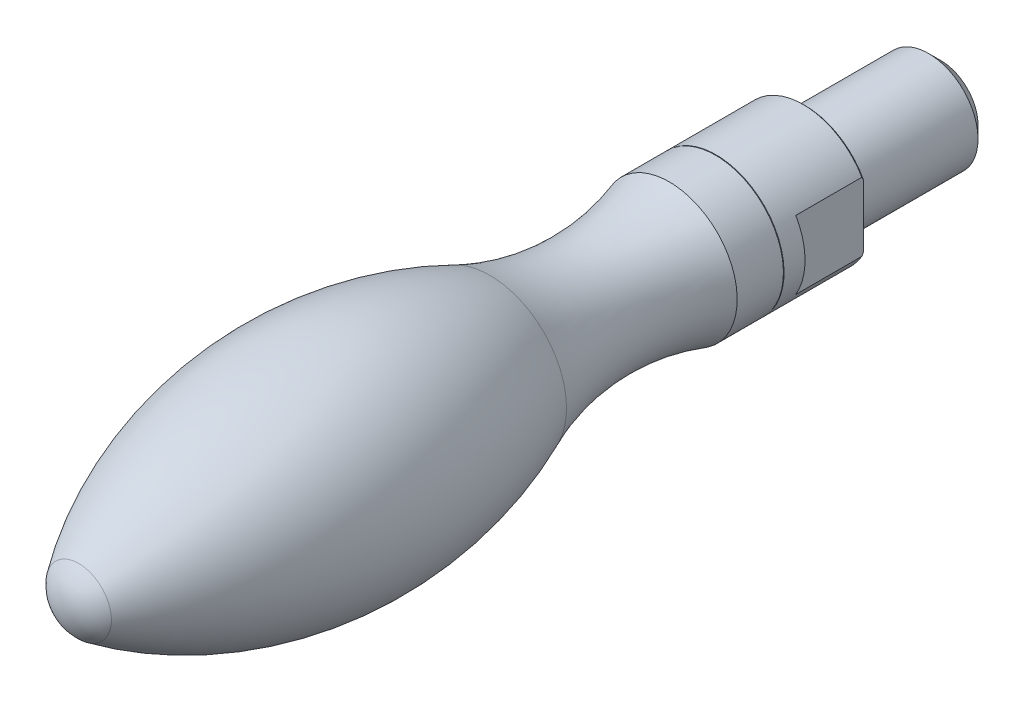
ISO-10303-21;
HEADER;
FILE_DESCRIPTION(('STEP AP214'),'2;1');
FILE_NAME('part.step','',(''),(''),'','','');
FILE_SCHEMA(('AUTOMOTIVE_DESIGN { 1 0 10303 214 1 1 1 1 }'));
ENDSEC;
DATA;
#1=APPLICATION_CONTEXT('core data for automotive mechanical design processes');
#2=APPLICATION_PROTOCOL_DEFINITION('international standard','automotive_design',2000,#1);
#3=PRODUCT_CONTEXT('',#1,'mechanical');
#4=PRODUCT('Part','Part','',(#3));
#5=PRODUCT_RELATED_PRODUCT_CATEGORY('part','',(#4));
#6=PRODUCT_DEFINITION_FORMATION('','',#4);
#7=PRODUCT_DEFINITION_CONTEXT('part definition',#1,'design');
#8=PRODUCT_DEFINITION('design','',#6,#7);
#9=PRODUCT_DEFINITION_SHAPE('','',#8);
#10=(LENGTH_UNIT() NAMED_UNIT(*) SI_UNIT(.MILLI.,.METRE.));
#11=(NAMED_UNIT(*) PLANE_ANGLE_UNIT() SI_UNIT($,.RADIAN.));
#12=(NAMED_UNIT(*) SI_UNIT($,.STERADIAN.) SOLID_ANGLE_UNIT());
#13=UNCERTAINTY_MEASURE_WITH_UNIT(LENGTH_MEASURE(1.E-05),#10,'distance_accuracy_value','');
#14=(GEOMETRIC_REPRESENTATION_CONTEXT(3) GLOBAL_UNCERTAINTY_ASSIGNED_CONTEXT((#13)) GLOBAL_UNIT_ASSIGNED_CONTEXT((#10,
#11,#12)) REPRESENTATION_CONTEXT('',''));
#15=CARTESIAN_POINT('',(0.,0.,0.));
#16=DIRECTION('',(0.,0.,1.));
#17=DIRECTION('',(1.,0.,0.));
#18=AXIS2_PLACEMENT_3D('',#15,#16,#17);
#19=CARTESIAN_POINT('',(0.,-5.38631639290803E-13,-27.));
#20=DIRECTION('',(0.,0.,-1.));
#21=DIRECTION('',(0.,-1.,0.));
#22=AXIS2_PLACEMENT_3D('',#19,#20,#21);
#23=CYLINDRICAL_SURFACE('',#22,11.0000000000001);
#24=CARTESIAN_POINT('',(0.,2.87270207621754E-13,14.3999999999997));
#25=DIRECTION('',(0.,0.,-1.));
#26=DIRECTION('',(0.,-1.,0.));
#27=AXIS2_PLACEMENT_3D('',#24,#25,#26);
#28=CIRCLE('',#27,11.);
#29=CARTESIAN_POINT('',(0.,-10.9999999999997,14.3999999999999));
#30=VERTEX_POINT('',#29);
#31=EDGE_CURVE('E191',#30,#30,#28,.T.);
#32=ORIENTED_EDGE('',*,*,#31,.T.);
#33=EDGE_LOOP('',(#32));
#34=FACE_BOUND('',#33,.T.);
#35=DIRECTION('',(0.,0.,-1.));
#36=VECTOR('',#35,1.);
#37=CARTESIAN_POINT('',(-9.49999999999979,-5.54526825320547,-27.));
#38=LINE('',#37,#36);
#39=CARTESIAN_POINT('',(-9.49999999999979,-5.54526825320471,11.));
#40=VERTEX_POINT('',#39);
#41=CARTESIAN_POINT('',(-9.49999999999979,-5.54526825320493,0.299999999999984));
#42=VERTEX_POINT('',#41);
#43=EDGE_CURVE('E192',#40,#42,#38,.T.);
#44=ORIENTED_EDGE('',*,*,#43,.T.);
#45=CARTESIAN_POINT('',(0.,0.,0.299999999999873));
#46=DIRECTION('',(0.,0.,1.));
#47=DIRECTION('',(0.,-1.,0.));
#48=AXIS2_PLACEMENT_3D('',#45,#46,#47);
#49=CIRCLE('',#48,11.0000000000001);
#50=CARTESIAN_POINT('',(9.5,-5.54526825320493,0.299999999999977));
#51=VERTEX_POINT('',#50);
#52=EDGE_CURVE('E37',#42,#51,#49,.T.);
#53=ORIENTED_EDGE('',*,*,#52,.T.);
#54=DIRECTION('',(0.,0.,-1.));
#55=VECTOR('',#54,1.);
#56=CARTESIAN_POINT('',(9.5,-5.54526825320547,-27.));
#57=LINE('',#56,#55);
#58=CARTESIAN_POINT('',(9.5,-5.54526825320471,11.));
#59=VERTEX_POINT('',#58);
#60=EDGE_CURVE('E73',#59,#51,#57,.T.);
#61=ORIENTED_EDGE('',*,*,#60,.F.);
#62=CARTESIAN_POINT('',(0.,2.19442519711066E-13,11.));
#63=DIRECTION('',(0.,0.,1.));
#64=DIRECTION('',(0.,1.,0.));
#65=AXIS2_PLACEMENT_3D('',#62,#63,#64);
#66=CIRCLE('',#65,11.0000000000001);
#67=CARTESIAN_POINT('',(9.5,5.54526825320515,10.9999999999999));
#68=VERTEX_POINT('',#67);
#69=EDGE_CURVE('E77',#59,#68,#66,.T.);
#70=ORIENTED_EDGE('',*,*,#69,.T.);
#71=DIRECTION('',(0.,0.,-1.));
#72=VECTOR('',#71,1.);
#73=CARTESIAN_POINT('',(9.5,5.54526825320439,-27.));
#74=LINE('',#73,#72);
#75=CARTESIAN_POINT('',(9.5,5.54526825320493,0.2999999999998));
#76=VERTEX_POINT('',#75);
#77=EDGE_CURVE('E67',#76,#68,#74,.F.);
#78=ORIENTED_EDGE('',*,*,#77,.F.);
#79=CARTESIAN_POINT('',(0.,0.,0.299999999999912));
#80=DIRECTION('',(0.,0.,1.));
#81=DIRECTION('',(0.,-1.,0.));
#82=AXIS2_PLACEMENT_3D('',#79,#80,#81);
#83=CIRCLE('',#82,11.0000000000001);
#84=CARTESIAN_POINT('',(-9.49999999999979,5.54526825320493,0.299999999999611));
#85=VERTEX_POINT('',#84);
#86=EDGE_CURVE('E232',#76,#85,#83,.T.);
#87=ORIENTED_EDGE('',*,*,#86,.T.);
#88=DIRECTION('',(0.,0.,-1.));
#89=VECTOR('',#88,1.);
#90=CARTESIAN_POINT('',(-9.49999999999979,5.54526825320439,-27.));
#91=LINE('',#90,#89);
#92=CARTESIAN_POINT('',(-9.49999999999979,5.54526825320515,10.9999999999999));
#93=VERTEX_POINT('',#92);
#94=EDGE_CURVE('E197',#85,#93,#91,.F.);
#95=ORIENTED_EDGE('',*,*,#94,.T.);
#96=CARTESIAN_POINT('',(0.,2.19442519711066E-13,11.));
#97=DIRECTION('',(0.,0.,-1.));
#98=DIRECTION('',(0.,-1.,0.));
#99=AXIS2_PLACEMENT_3D('',#96,#97,#98);
#100=CIRCLE('',#99,11.0000000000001);
#101=EDGE_CURVE('E85',#40,#93,#100,.T.);
#102=ORIENTED_EDGE('',*,*,#101,.F.);
#103=EDGE_LOOP('',(#44,#53,#61,#70,#78,#87,#95,#102));
#104=FACE_BOUND('',#103,.T.);
#105=ADVANCED_FACE('F14',(#34,#104),#23,.T.);
#106=CARTESIAN_POINT('',(-11.0000000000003,0.,0.));
#107=DIRECTION('',(0.,0.,1.));
#108=DIRECTION('',(0.,1.,0.));
#109=AXIS2_PLACEMENT_3D('',#106,#107,#108);
#110=PLANE('',#109);
#111=CARTESIAN_POINT('',(0.,0.,0.));
#112=DIRECTION('',(0.,0.,-1.));
#113=DIRECTION('',(0.,-1.,0.));
#114=AXIS2_PLACEMENT_3D('',#111,#112,#113);
#115=CIRCLE('',#114,8.);
#116=CARTESIAN_POINT('',(0.,-8.,1.59594559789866E-13));
#117=VERTEX_POINT('',#116);
#118=EDGE_CURVE('E190',#117,#117,#115,.T.);
#119=ORIENTED_EDGE('',*,*,#118,.F.);
#120=EDGE_LOOP('',(#119));
#121=FACE_BOUND('',#120,.T.);
#122=DIRECTION('',(0.,1.,0.));
#123=VECTOR('',#122,1.);
#124=CARTESIAN_POINT('',(9.5,0.,0.));
#125=LINE('',#124,#123);
#126=CARTESIAN_POINT('',(9.5,-4.923413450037,0.));
#127=VERTEX_POINT('',#126);
#128=CARTESIAN_POINT('',(9.5,4.92341345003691,0.));
#129=VERTEX_POINT('',#128);
#130=EDGE_CURVE('E80',#127,#129,#125,.T.);
#131=ORIENTED_EDGE('',*,*,#130,.F.);
#132=CARTESIAN_POINT('',(0.,0.,0.));
#133=DIRECTION('',(0.,0.,1.));
#134=DIRECTION('',(0.,-1.,0.));
#135=AXIS2_PLACEMENT_3D('',#132,#133,#134);
#136=CIRCLE('',#135,10.7000000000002);
#137=CARTESIAN_POINT('',(-9.49999999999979,-4.9234134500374,0.));
#138=VERTEX_POINT('',#137);
#139=EDGE_CURVE('E83',#127,#138,#136,.F.);
#140=ORIENTED_EDGE('',*,*,#139,.T.);
#141=DIRECTION('',(0.,1.,0.));
#142=VECTOR('',#141,1.);
#143=CARTESIAN_POINT('',(-9.49999999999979,0.,0.));
#144=LINE('',#143,#142);
#145=CARTESIAN_POINT('',(-9.49999999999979,4.92341345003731,0.));
#146=VERTEX_POINT('',#145);
#147=EDGE_CURVE('E215',#138,#146,#144,.T.);
#148=ORIENTED_EDGE('',*,*,#147,.T.);
#149=CARTESIAN_POINT('',(0.,0.,0.));
#150=DIRECTION('',(0.,0.,1.));
#151=DIRECTION('',(0.,-1.,0.));
#152=AXIS2_PLACEMENT_3D('',#149,#150,#151);
#153=CIRCLE('',#152,10.7000000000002);
#154=EDGE_CURVE('E79',#146,#129,#153,.F.);
#155=ORIENTED_EDGE('',*,*,#154,.T.);
#156=EDGE_LOOP('',(#131,#140,#148,#155));
#157=FACE_BOUND('',#156,.T.);
#158=ADVANCED_FACE('F125',(#121,#157),#110,.F.);
#159=CARTESIAN_POINT('',(-7.99999999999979,-4.38885039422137E-13,-22.));
#160=DIRECTION('',(0.,0.,1.));
#161=DIRECTION('',(0.,1.,0.));
#162=AXIS2_PLACEMENT_3D('',#159,#160,#161);
#163=PLANE('',#162);
#164=CARTESIAN_POINT('',(0.,-4.38885039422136E-13,-22.));
#165=DIRECTION('',(0.,0.,1.));
#166=DIRECTION('',(0.,-1.,0.));
#167=AXIS2_PLACEMENT_3D('',#164,#165,#166);
#168=CIRCLE('',#167,6.);
#169=CARTESIAN_POINT('',(0.,-6.00000000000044,-21.9999999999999));
#170=VERTEX_POINT('',#169);
#171=EDGE_CURVE('E22',#170,#170,#168,.F.);
#172=ORIENTED_EDGE('',*,*,#171,.T.);
#173=EDGE_LOOP('',(#172));
#174=FACE_BOUND('',#173,.T.);
#175=ADVANCED_FACE('F128',(#174),#163,.F.);
#176=CARTESIAN_POINT('',(0.,2.25427315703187E-12,113.));
#177=DIRECTION('',(0.,-1.,0.));
#178=DIRECTION('',(0.,0.,1.));
#179=AXIS2_PLACEMENT_3D('',#176,#177,#178);
#180=SPHERICAL_SURFACE('',#179,7.);
#181=CARTESIAN_POINT('',(0.,2.25427315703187E-12,113.));
#182=DIRECTION('',(0.,0.,-1.));
#183=DIRECTION('',(0.,-1.,0.));
#184=AXIS2_PLACEMENT_3D('',#181,#182,#183);
#185=SPHERICAL_SURFACE('',#184,7.);
#186=CARTESIAN_POINT('',(0.,2.34560863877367E-12,117.57837569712));
#187=DIRECTION('',(0.,0.,-1.));
#188=DIRECTION('',(0.,-1.,0.));
#189=AXIS2_PLACEMENT_3D('',#186,#187,#188);
#190=CIRCLE('',#189,5.29513701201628);
#191=CARTESIAN_POINT('',(0.,-5.29513701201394,117.57837569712));
#192=VERTEX_POINT('',#191);
#193=EDGE_CURVE('E212',#192,#192,#190,.T.);
#194=ORIENTED_EDGE('',*,*,#193,.F.);
#195=EDGE_LOOP('',(#194));
#196=FACE_BOUND('',#195,.T.);
#197=ADVANCED_FACE('F151',(#196),#185,.T.);
#198=CARTESIAN_POINT('',(0.,1.5560469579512E-12,78.));
#199=DIRECTION('',(0.,0.,-1.));
#200=DIRECTION('',(0.,-1.,0.));
#201=AXIS2_PLACEMENT_3D('',#198,#199,#200);
#202=DEGENERATE_TOROIDAL_SURFACE('',#201,50.,68.,.F.);
#203=CARTESIAN_POINT('',(0.,1.01812812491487E-12,51.0357308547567));
#204=DIRECTION('',(0.,0.,-1.));
#205=DIRECTION('',(0.,-1.,0.));
#206=AXIS2_PLACEMENT_3D('',#203,#204,#205);
#207=CIRCLE('',#206,12.4253809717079);
#208=CARTESIAN_POINT('',(0.,-12.4253809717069,51.0357308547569));
#209=VERTEX_POINT('',#208);
#210=EDGE_CURVE('E209',#209,#209,#207,.T.);
#211=ORIENTED_EDGE('',*,*,#210,.F.);
#212=EDGE_LOOP('',(#211));
#213=FACE_BOUND('',#212,.T.);
#214=ORIENTED_EDGE('',*,*,#193,.T.);
#215=EDGE_LOOP('',(#214));
#216=FACE_BOUND('',#215,.T.);
#217=ADVANCED_FACE('F147',(#213,#216),#202,.F.);
#218=CARTESIAN_POINT('',(0.,6.90844950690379E-13,34.63));
#219=DIRECTION('',(0.,0.,-1.));
#220=DIRECTION('',(0.,-1.,0.));
#221=AXIS2_PLACEMENT_3D('',#218,#219,#220);
#222=TOROIDAL_SURFACE('',#221,50.,41.);
#223=ORIENTED_EDGE('',*,*,#210,.T.);
#224=EDGE_LOOP('',(#223));
#225=FACE_BOUND('',#224,.T.);
#226=CARTESIAN_POINT('',(0.,4.38503795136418E-13,21.9808893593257));
#227=DIRECTION('',(0.,0.,-1.));
#228=DIRECTION('',(0.,-1.,0.));
#229=AXIS2_PLACEMENT_3D('',#226,#227,#228);
#230=CIRCLE('',#229,11.);
#231=CARTESIAN_POINT('',(0.,-10.9999999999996,21.9808893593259));
#232=VERTEX_POINT('',#231);
#233=EDGE_CURVE('E206',#232,#232,#230,.T.);
#234=ORIENTED_EDGE('',*,*,#233,.F.);
#235=EDGE_LOOP('',(#234));
#236=FACE_BOUND('',#235,.T.);
#237=ADVANCED_FACE('F143',(#225,#236),#222,.F.);
#238=CARTESIAN_POINT('',(0.,-5.38631639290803E-13,-27.));
#239=DIRECTION('',(0.,0.,-1.));
#240=DIRECTION('',(0.,-1.,0.));
#241=AXIS2_PLACEMENT_3D('',#238,#239,#240);
#242=CYLINDRICAL_SURFACE('',#241,11.);
#243=CARTESIAN_POINT('',(0.,2.89265139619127E-13,14.4999999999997));
#244=DIRECTION('',(0.,0.,-1.));
#245=DIRECTION('',(0.,-1.,0.));
#246=AXIS2_PLACEMENT_3D('',#243,#244,#245);
#247=CIRCLE('',#246,11.);
#248=CARTESIAN_POINT('',(0.,-10.9999999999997,14.4999999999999));
#249=VERTEX_POINT('',#248);
#250=EDGE_CURVE('E203',#249,#249,#247,.T.);
#251=ORIENTED_EDGE('',*,*,#250,.F.);
#252=EDGE_LOOP('',(#251));
#253=FACE_BOUND('',#252,.T.);
#254=ORIENTED_EDGE('',*,*,#233,.T.);
#255=EDGE_LOOP('',(#254));
#256=FACE_BOUND('',#255,.T.);
#257=ADVANCED_FACE('F139',(#253,#256),#242,.T.);
#258=CARTESIAN_POINT('',(-10.9999999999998,2.89265139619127E-13,14.4999999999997));
#259=DIRECTION('',(0.,0.,1.));
#260=DIRECTION('',(0.,1.,0.));
#261=AXIS2_PLACEMENT_3D('',#258,#259,#260);
#262=PLANE('',#261);
#263=CARTESIAN_POINT('',(0.,2.89265139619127E-13,14.4999999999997));
#264=DIRECTION('',(0.,0.,-1.));
#265=DIRECTION('',(0.,-1.,0.));
#266=AXIS2_PLACEMENT_3D('',#263,#264,#265);
#267=CIRCLE('',#266,10.9045745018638);
#268=CARTESIAN_POINT('',(0.,-10.9045745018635,14.4999999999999));
#269=VERTEX_POINT('',#268);
#270=EDGE_CURVE('E195',#269,#269,#267,.T.);
#271=ORIENTED_EDGE('',*,*,#270,.F.);
#272=EDGE_LOOP('',(#271));
#273=FACE_BOUND('',#272,.T.);
#274=ORIENTED_EDGE('',*,*,#250,.T.);
#275=EDGE_LOOP('',(#274));
#276=FACE_BOUND('',#275,.T.);
#277=ADVANCED_FACE('F135',(#273,#276),#262,.F.);
#278=CARTESIAN_POINT('',(0.,2.87270207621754E-13,14.3999999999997));
#279=DIRECTION('',(0.,0.,-1.));
#280=DIRECTION('',(0.,-1.,0.));
#281=AXIS2_PLACEMENT_3D('',#278,#279,#280);
#282=CONICAL_SURFACE('',#281,11.,0.761994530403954);
#283=ORIENTED_EDGE('',*,*,#270,.T.);
#284=EDGE_LOOP('',(#283));
#285=FACE_BOUND('',#284,.T.);
#286=ORIENTED_EDGE('',*,*,#31,.F.);
#287=EDGE_LOOP('',(#286));
#288=FACE_BOUND('',#287,.T.);
#289=ADVANCED_FACE('F123',(#285,#288),#282,.T.);
#290=CARTESIAN_POINT('',(0.,-5.38631639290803E-13,-27.));
#291=DIRECTION('',(0.,0.,-1.));
#292=DIRECTION('',(0.,-1.,0.));
#293=AXIS2_PLACEMENT_3D('',#290,#291,#292);
#294=CYLINDRICAL_SURFACE('',#293,8.);
#295=CARTESIAN_POINT('',(0.,-3.98986399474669E-13,-20.));
#296=DIRECTION('',(0.,0.,1.));
#297=DIRECTION('',(0.,-1.,0.));
#298=AXIS2_PLACEMENT_3D('',#295,#296,#297);
#299=CIRCLE('',#298,8.);
#300=CARTESIAN_POINT('',(0.,-8.0000000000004,-19.9999999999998));
#301=VERTEX_POINT('',#300);
#302=EDGE_CURVE('E9',#301,#301,#299,.T.);
#303=ORIENTED_EDGE('',*,*,#302,.T.);
#304=EDGE_LOOP('',(#303));
#305=FACE_BOUND('',#304,.T.);
#306=ORIENTED_EDGE('',*,*,#118,.T.);
#307=EDGE_LOOP('',(#306));
#308=FACE_BOUND('',#307,.T.);
#309=ADVANCED_FACE('F119',(#305,#308),#294,.T.);
#310=CARTESIAN_POINT('',(-14.6388310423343,10.0000000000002,10.9999999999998));
#311=DIRECTION('',(0.,0.,-1.));
#312=DIRECTION('',(0.,-1.,0.));
#313=AXIS2_PLACEMENT_3D('',#310,#311,#312);
#314=PLANE('',#313);
#315=ORIENTED_EDGE('',*,*,#101,.T.);
#316=DIRECTION('',(0.,-1.,0.));
#317=VECTOR('',#316,1.);
#318=CARTESIAN_POINT('',(-9.49999999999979,10.0000000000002,10.9999999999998));
#319=LINE('',#318,#317);
#320=EDGE_CURVE('E221',#93,#40,#319,.T.);
#321=ORIENTED_EDGE('',*,*,#320,.T.);
#322=EDGE_LOOP('',(#315,#321));
#323=FACE_BOUND('',#322,.T.);
#324=ADVANCED_FACE('F112',(#323),#314,.T.);
#325=CARTESIAN_POINT('',(-9.49999999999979,10.,-3.61944919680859));
#326=DIRECTION('',(1.,0.,0.));
#327=DIRECTION('',(0.,1.,0.));
#328=AXIS2_PLACEMENT_3D('',#325,#326,#327);
#329=PLANE('',#328);
#330=ORIENTED_EDGE('',*,*,#147,.F.);
#331=CARTESIAN_POINT('',(-9.49999999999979,-4.9234134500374,0.));
#332=CARTESIAN_POINT('',(-9.49999999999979,-4.97568713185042,0.0240528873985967));
#333=CARTESIAN_POINT('',(-9.49999999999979,-5.02784605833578,0.048354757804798));
#334=CARTESIAN_POINT('',(-9.49999999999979,-5.13193348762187,0.0974364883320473));
#335=CARTESIAN_POINT('',(-9.49999999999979,-5.18386200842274,0.122216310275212));
#336=CARTESIAN_POINT('',(-9.49999999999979,-5.28749584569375,0.172237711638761));
#337=CARTESIAN_POINT('',(-9.49999999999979,-5.33920116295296,0.197479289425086));
#338=CARTESIAN_POINT('',(-9.49999999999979,-5.44239641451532,0.24840925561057));
#339=CARTESIAN_POINT('',(-9.49999999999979,-5.49388633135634,0.274097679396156));
#340=CARTESIAN_POINT('',(-9.49999999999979,-5.54526825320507,0.299999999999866));
#341=B_SPLINE_CURVE_WITH_KNOTS('',3,(#331,#332,#333,#334,#335,#336,#337,#338,#339,#340),
.UNSPECIFIED.,.F.,.F.,(4,2,2,2,4),(0.,0.172625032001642,0.34523633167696,0.517847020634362,
0.690471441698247),.UNSPECIFIED.);
#342=EDGE_CURVE('E98',#138,#42,#341,.T.);
#343=ORIENTED_EDGE('',*,*,#342,.T.);
#344=ORIENTED_EDGE('',*,*,#43,.F.);
#345=ORIENTED_EDGE('',*,*,#320,.F.);
#346=ORIENTED_EDGE('',*,*,#94,.F.);
#347=CARTESIAN_POINT('',(-9.5,5.54526825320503,0.299999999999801));
#348=CARTESIAN_POINT('',(-9.49999999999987,5.49388633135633,0.274097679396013));
#349=CARTESIAN_POINT('',(-9.49999999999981,5.44239641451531,0.248409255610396));
#350=CARTESIAN_POINT('',(-9.49999999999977,5.33920116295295,0.197479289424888));
#351=CARTESIAN_POINT('',(-9.49999999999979,5.28749584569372,0.172237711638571));
#352=CARTESIAN_POINT('',(-9.4999999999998,5.18386200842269,0.122216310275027));
#353=CARTESIAN_POINT('',(-9.49999999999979,5.13193348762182,0.0974364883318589));
#354=CARTESIAN_POINT('',(-9.49999999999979,5.02784605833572,0.0483547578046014));
#355=CARTESIAN_POINT('',(-9.49999999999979,4.97568713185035,0.0240528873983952));
#356=CARTESIAN_POINT('',(-9.49999999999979,4.92341345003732,-1.04267861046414E-13));
#357=B_SPLINE_CURVE_WITH_KNOTS('',3,(#347,#348,#349,#350,#351,#352,#353,#354,#355,#356),
.UNSPECIFIED.,.F.,.F.,(4,2,2,2,4),(0.,0.172624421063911,0.345235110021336,0.517846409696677,
0.690471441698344),.UNSPECIFIED.);
#358=EDGE_CURVE('E91',#85,#146,#357,.T.);
#359=ORIENTED_EDGE('',*,*,#358,.T.);
#360=EDGE_LOOP('',(#330,#343,#344,#345,#346,#359));
#361=FACE_BOUND('',#360,.T.);
#362=ADVANCED_FACE('F107',(#361),#329,.F.);
#363=CARTESIAN_POINT('',(14.6388310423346,10.0000000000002,10.9999999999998));
#364=DIRECTION('',(0.,0.,1.));
#365=DIRECTION('',(0.,1.,0.));
#366=AXIS2_PLACEMENT_3D('',#363,#364,#365);
#367=PLANE('',#366);
#368=DIRECTION('',(0.,-1.,0.));
#369=VECTOR('',#368,1.);
#370=CARTESIAN_POINT('',(9.5,10.0000000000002,10.9999999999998));
#371=LINE('',#370,#369);
#372=EDGE_CURVE('E70',#68,#59,#371,.T.);
#373=ORIENTED_EDGE('',*,*,#372,.F.);
#374=ORIENTED_EDGE('',*,*,#69,.F.);
#375=EDGE_LOOP('',(#373,#374));
#376=FACE_BOUND('',#375,.T.);
#377=ADVANCED_FACE('F76',(#376),#367,.F.);
#378=CARTESIAN_POINT('',(9.5,10.,-3.61944919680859));
#379=DIRECTION('',(1.,0.,0.));
#380=DIRECTION('',(0.,1.,0.));
#381=AXIS2_PLACEMENT_3D('',#378,#379,#380);
#382=PLANE('',#381);
#383=ORIENTED_EDGE('',*,*,#60,.T.);
#384=CARTESIAN_POINT('',(9.5,-5.54526825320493,0.299999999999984));
#385=CARTESIAN_POINT('',(9.5,-5.49388633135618,0.274097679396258));
#386=CARTESIAN_POINT('',(9.5,-5.44239641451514,0.248409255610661));
#387=CARTESIAN_POINT('',(9.5,-5.33920116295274,0.197479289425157));
#388=CARTESIAN_POINT('',(9.5,-5.2874958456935,0.172237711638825));
#389=CARTESIAN_POINT('',(9.5,-5.18386200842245,0.122216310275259));
#390=CARTESIAN_POINT('',(9.5,-5.13193348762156,0.0974364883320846));
#391=CARTESIAN_POINT('',(9.5,-5.02784605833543,0.0483547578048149));
#392=CARTESIAN_POINT('',(9.5,-4.97568713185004,0.0240528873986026));
#393=CARTESIAN_POINT('',(9.5,-4.923413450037,0.));
#394=B_SPLINE_CURVE_WITH_KNOTS('',3,(#384,#385,#386,#387,#388,#389,#390,#391,#392,#393),
.UNSPECIFIED.,.F.,.F.,(4,2,2,2,4),(0.,0.172624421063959,0.345235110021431,0.517846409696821,
0.690471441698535),.UNSPECIFIED.);
#395=EDGE_CURVE('E164',#51,#127,#394,.T.);
#396=ORIENTED_EDGE('',*,*,#395,.T.);
#397=ORIENTED_EDGE('',*,*,#130,.T.);
#398=CARTESIAN_POINT('',(9.5,4.92341345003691,0.));
#399=CARTESIAN_POINT('',(9.5,4.97568713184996,0.024052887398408));
#400=CARTESIAN_POINT('',(9.5,5.02784605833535,0.0483547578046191));
#401=CARTESIAN_POINT('',(9.5,5.1319334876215,0.0974364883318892));
#402=CARTESIAN_POINT('',(9.5,5.1838620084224,0.122216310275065));
#403=CARTESIAN_POINT('',(9.5,5.28749584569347,0.172237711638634));
#404=CARTESIAN_POINT('',(9.5,5.33920116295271,0.197479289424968));
#405=CARTESIAN_POINT('',(9.5,5.44239641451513,0.248409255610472));
#406=CARTESIAN_POINT('',(9.5,5.49388633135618,0.274097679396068));
#407=CARTESIAN_POINT('',(9.5,5.54526825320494,0.299999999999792));
#408=B_SPLINE_CURVE_WITH_KNOTS('',3,(#398,#399,#400,#401,#402,#403,#404,#405,#406,#407),
.UNSPECIFIED.,.F.,.F.,(4,2,2,2,4),(0.,0.172625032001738,0.345236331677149,0.517847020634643,
0.690471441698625),.UNSPECIFIED.);
#409=EDGE_CURVE('E29',#129,#76,#408,.T.);
#410=ORIENTED_EDGE('',*,*,#409,.T.);
#411=ORIENTED_EDGE('',*,*,#77,.T.);
#412=ORIENTED_EDGE('',*,*,#372,.T.);
#413=EDGE_LOOP('',(#383,#396,#397,#410,#411,#412));
#414=FACE_BOUND('',#413,.T.);
#415=ADVANCED_FACE('F69',(#414),#382,.T.);
#416=CARTESIAN_POINT('',(0.,0.,0.));
#417=DIRECTION('',(0.,0.,1.));
#418=DIRECTION('',(0.,-1.,0.));
#419=AXIS2_PLACEMENT_3D('',#416,#417,#418);
#420=CONICAL_SURFACE('',#419,10.7000000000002,0.785398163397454);
#421=ORIENTED_EDGE('',*,*,#395,.F.);
#422=ORIENTED_EDGE('',*,*,#52,.F.);
#423=ORIENTED_EDGE('',*,*,#342,.F.);
#424=ORIENTED_EDGE('',*,*,#139,.F.);
#425=EDGE_LOOP('',(#421,#422,#423,#424));
#426=FACE_BOUND('',#425,.T.);
#427=ADVANCED_FACE('F158',(#426),#420,.T.);
#428=CARTESIAN_POINT('',(0.,0.,0.));
#429=DIRECTION('',(0.,0.,1.));
#430=DIRECTION('',(0.,-1.,0.));
#431=AXIS2_PLACEMENT_3D('',#428,#429,#430);
#432=CONICAL_SURFACE('',#431,10.7000000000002,0.785398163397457);
#433=ORIENTED_EDGE('',*,*,#358,.F.);
#434=ORIENTED_EDGE('',*,*,#86,.F.);
#435=ORIENTED_EDGE('',*,*,#409,.F.);
#436=ORIENTED_EDGE('',*,*,#154,.F.);
#437=EDGE_LOOP('',(#433,#434,#435,#436));
#438=FACE_BOUND('',#437,.T.);
#439=ADVANCED_FACE('F105',(#438),#432,.T.);
#440=CARTESIAN_POINT('',(0.,-4.38885039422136E-13,-22.));
#441=DIRECTION('',(0.,0.,1.));
#442=DIRECTION('',(0.,-1.,0.));
#443=AXIS2_PLACEMENT_3D('',#440,#441,#442);
#444=CONICAL_SURFACE('',#443,6.,0.785398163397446);
#445=ORIENTED_EDGE('',*,*,#302,.F.);
#446=EDGE_LOOP('',(#445));
#447=FACE_BOUND('',#446,.T.);
#448=ORIENTED_EDGE('',*,*,#171,.F.);
#449=EDGE_LOOP('',(#448));
#450=FACE_BOUND('',#449,.T.);
#451=ADVANCED_FACE('F16',(#447,#450),#444,.T.);
#452=CLOSED_SHELL('',(#105,#158,#175,#197,#217,#237,#257,#277,#289,#309,#324,#362,#377,#415,
#427,#439,#451));
#453=MANIFOLD_SOLID_BREP('B1',#452);
#454=ADVANCED_BREP_SHAPE_REPRESENTATION('',(#18,#453),#14);
#455=SHAPE_DEFINITION_REPRESENTATION(#9,#454);
ENDSEC;
END-ISO-10303-21;
